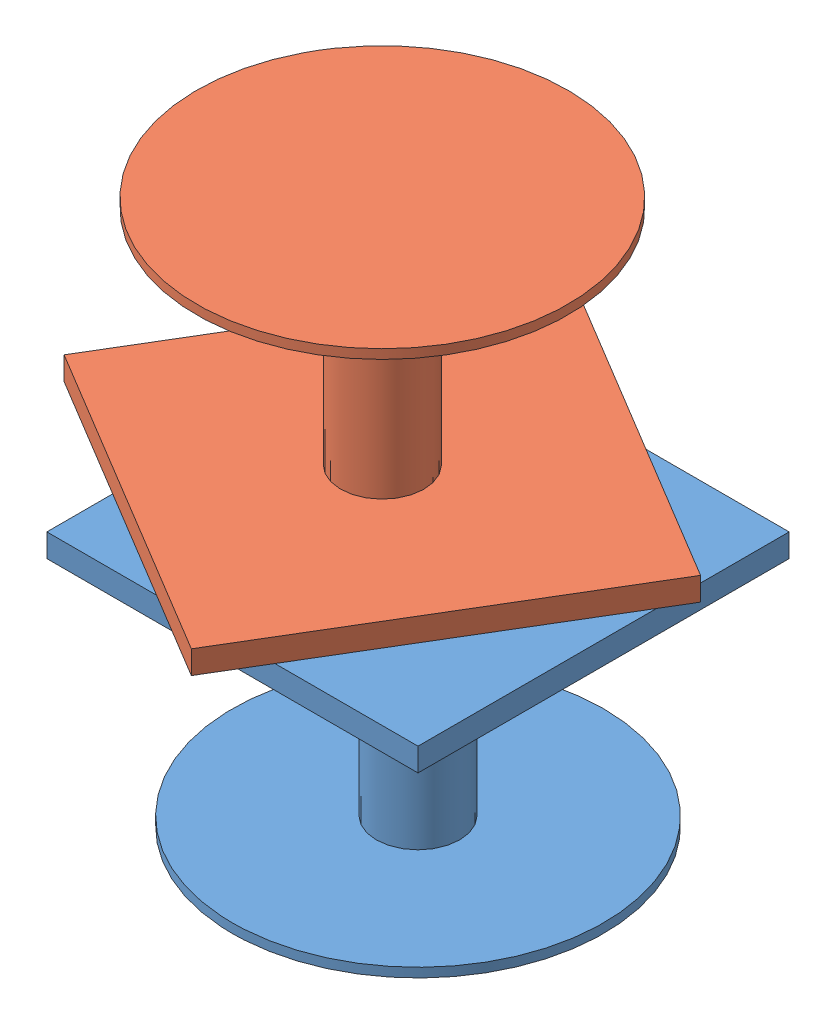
SolidWorks assembly Assemblage2.SLDASM, configuration Défaut (file format 4700). Lengths in mm.
Overall size (109.76 110 109.76).
2 component instances, 2 part files, 1 mates.
Components (placement in the parent):
- support-1: support.SLDPRT [Défaut] at (0.0821 31.193 0) size (80 91.41 80)
- mobile-1: mobile.SLDPRT [Défaut] at (-11.2305 1.193 -3.6232) x (0.514557 0 -0.857456) z (-0.857456 0 -0.514557) size (80 91.41 80)
Mates (geometry in assembly coordinates):
- Coïncidente1: coincident anti-aligned: plane of support-1 through (40.0821 16.193 -40) normal (0 1 0); plane of mobile-1 through (43.6501 16.193 -17.3392) normal (0 -1 0)
